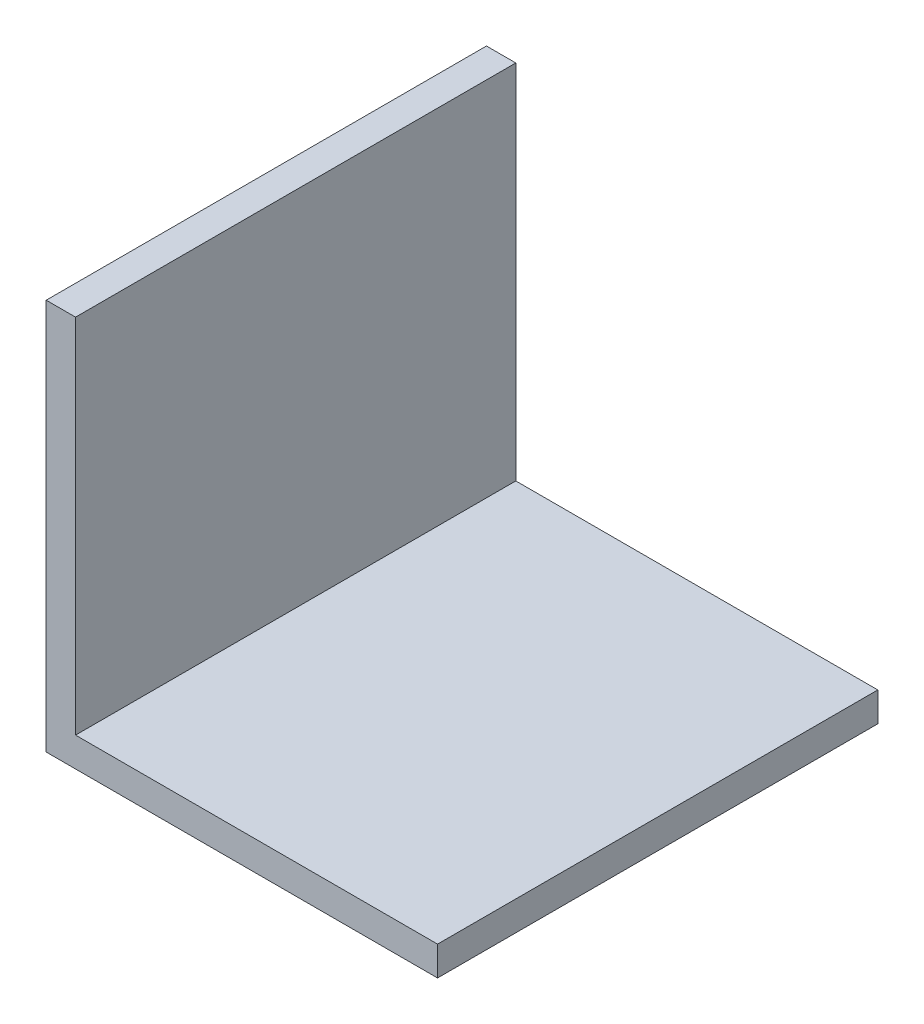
ISO-10303-21;
HEADER;
FILE_DESCRIPTION(('STEP AP214'),'2;1');
FILE_NAME('part.step','',(''),(''),'','','');
FILE_SCHEMA(('AUTOMOTIVE_DESIGN { 1 0 10303 214 1 1 1 1 }'));
ENDSEC;
DATA;
#1=APPLICATION_CONTEXT('core data for automotive mechanical design processes');
#2=APPLICATION_PROTOCOL_DEFINITION('international standard','automotive_design',2000,#1);
#3=PRODUCT_CONTEXT('',#1,'mechanical');
#4=PRODUCT('Part','Part','',(#3));
#5=PRODUCT_RELATED_PRODUCT_CATEGORY('part','',(#4));
#6=PRODUCT_DEFINITION_FORMATION('','',#4);
#7=PRODUCT_DEFINITION_CONTEXT('part definition',#1,'design');
#8=PRODUCT_DEFINITION('design','',#6,#7);
#9=PRODUCT_DEFINITION_SHAPE('','',#8);
#10=(LENGTH_UNIT() NAMED_UNIT(*) SI_UNIT(.MILLI.,.METRE.));
#11=(NAMED_UNIT(*) PLANE_ANGLE_UNIT() SI_UNIT($,.RADIAN.));
#12=(NAMED_UNIT(*) SI_UNIT($,.STERADIAN.) SOLID_ANGLE_UNIT());
#13=UNCERTAINTY_MEASURE_WITH_UNIT(LENGTH_MEASURE(1.E-05),#10,'distance_accuracy_value','');
#14=(GEOMETRIC_REPRESENTATION_CONTEXT(3) GLOBAL_UNCERTAINTY_ASSIGNED_CONTEXT((#13)) GLOBAL_UNIT_ASSIGNED_CONTEXT((#10,
#11,#12)) REPRESENTATION_CONTEXT('',''));
#15=CARTESIAN_POINT('',(0.,0.,0.));
#16=DIRECTION('',(0.,0.,1.));
#17=DIRECTION('',(1.,0.,0.));
#18=AXIS2_PLACEMENT_3D('',#15,#16,#17);
#19=CARTESIAN_POINT('',(0.,0.,90.));
#20=DIRECTION('',(1.,0.,0.));
#21=DIRECTION('',(0.,0.,-1.));
#22=AXIS2_PLACEMENT_3D('',#19,#20,#21);
#23=PLANE('',#22);
#24=DIRECTION('',(0.,-1.,0.));
#25=VECTOR('',#24,1.);
#26=CARTESIAN_POINT('',(0.,0.,0.));
#27=LINE('',#26,#25);
#28=CARTESIAN_POINT('',(0.,80.,0.));
#29=VERTEX_POINT('',#28);
#30=CARTESIAN_POINT('',(0.,0.,0.));
#31=VERTEX_POINT('',#30);
#32=EDGE_CURVE('E117',#29,#31,#27,.T.);
#33=ORIENTED_EDGE('',*,*,#32,.T.);
#34=DIRECTION('',(0.,0.,-1.));
#35=VECTOR('',#34,1.);
#36=CARTESIAN_POINT('',(0.,0.,90.));
#37=LINE('',#36,#35);
#38=CARTESIAN_POINT('',(0.,0.,90.));
#39=VERTEX_POINT('',#38);
#40=EDGE_CURVE('E11',#39,#31,#37,.T.);
#41=ORIENTED_EDGE('',*,*,#40,.F.);
#42=DIRECTION('',(0.,-1.,0.));
#43=VECTOR('',#42,1.);
#44=CARTESIAN_POINT('',(0.,0.,90.));
#45=LINE('',#44,#43);
#46=CARTESIAN_POINT('',(0.,80.,90.));
#47=VERTEX_POINT('',#46);
#48=EDGE_CURVE('E127',#47,#39,#45,.T.);
#49=ORIENTED_EDGE('',*,*,#48,.F.);
#50=DIRECTION('',(0.,0.,-1.));
#51=VECTOR('',#50,1.);
#52=CARTESIAN_POINT('',(0.,80.,90.));
#53=LINE('',#52,#51);
#54=EDGE_CURVE('E113',#47,#29,#53,.T.);
#55=ORIENTED_EDGE('',*,*,#54,.T.);
#56=EDGE_LOOP('',(#33,#41,#49,#55));
#57=FACE_BOUND('',#56,.T.);
#58=ADVANCED_FACE('F33',(#57),#23,.F.);
#59=CARTESIAN_POINT('',(0.,0.,90.));
#60=DIRECTION('',(0.,1.,0.));
#61=DIRECTION('',(0.,0.,1.));
#62=AXIS2_PLACEMENT_3D('',#59,#60,#61);
#63=PLANE('',#62);
#64=DIRECTION('',(1.,0.,0.));
#65=VECTOR('',#64,1.);
#66=CARTESIAN_POINT('',(0.,0.,0.));
#67=LINE('',#66,#65);
#68=CARTESIAN_POINT('',(80.,0.,0.));
#69=VERTEX_POINT('',#68);
#70=EDGE_CURVE('E120',#31,#69,#67,.T.);
#71=ORIENTED_EDGE('',*,*,#70,.T.);
#72=DIRECTION('',(0.,0.,-1.));
#73=VECTOR('',#72,1.);
#74=CARTESIAN_POINT('',(80.,0.,90.));
#75=LINE('',#74,#73);
#76=CARTESIAN_POINT('',(80.,0.,90.));
#77=VERTEX_POINT('',#76);
#78=EDGE_CURVE('E41',#77,#69,#75,.T.);
#79=ORIENTED_EDGE('',*,*,#78,.F.);
#80=DIRECTION('',(1.,0.,0.));
#81=VECTOR('',#80,1.);
#82=CARTESIAN_POINT('',(0.,0.,90.));
#83=LINE('',#82,#81);
#84=EDGE_CURVE('E86',#39,#77,#83,.T.);
#85=ORIENTED_EDGE('',*,*,#84,.F.);
#86=ORIENTED_EDGE('',*,*,#40,.T.);
#87=EDGE_LOOP('',(#71,#79,#85,#86));
#88=FACE_BOUND('',#87,.T.);
#89=ADVANCED_FACE('F151',(#88),#63,.F.);
#90=CARTESIAN_POINT('',(80.,0.,90.));
#91=DIRECTION('',(-1.,0.,0.));
#92=DIRECTION('',(0.,0.,1.));
#93=AXIS2_PLACEMENT_3D('',#90,#91,#92);
#94=PLANE('',#93);
#95=DIRECTION('',(0.,1.,0.));
#96=VECTOR('',#95,1.);
#97=CARTESIAN_POINT('',(80.,0.,0.));
#98=LINE('',#97,#96);
#99=CARTESIAN_POINT('',(80.,6.,0.));
#100=VERTEX_POINT('',#99);
#101=EDGE_CURVE('E122',#69,#100,#98,.T.);
#102=ORIENTED_EDGE('',*,*,#101,.T.);
#103=DIRECTION('',(0.,0.,-1.));
#104=VECTOR('',#103,1.);
#105=CARTESIAN_POINT('',(80.,6.,90.));
#106=LINE('',#105,#104);
#107=CARTESIAN_POINT('',(80.,6.,90.));
#108=VERTEX_POINT('',#107);
#109=EDGE_CURVE('E108',#108,#100,#106,.T.);
#110=ORIENTED_EDGE('',*,*,#109,.F.);
#111=DIRECTION('',(0.,1.,0.));
#112=VECTOR('',#111,1.);
#113=CARTESIAN_POINT('',(80.,0.,90.));
#114=LINE('',#113,#112);
#115=EDGE_CURVE('E99',#77,#108,#114,.T.);
#116=ORIENTED_EDGE('',*,*,#115,.F.);
#117=ORIENTED_EDGE('',*,*,#78,.T.);
#118=EDGE_LOOP('',(#102,#110,#116,#117));
#119=FACE_BOUND('',#118,.T.);
#120=ADVANCED_FACE('F133',(#119),#94,.F.);
#121=CARTESIAN_POINT('',(80.,6.,90.));
#122=DIRECTION('',(0.,-1.,0.));
#123=DIRECTION('',(1.,0.,0.));
#124=AXIS2_PLACEMENT_3D('',#121,#122,#123);
#125=PLANE('',#124);
#126=DIRECTION('',(-1.,0.,0.));
#127=VECTOR('',#126,1.);
#128=CARTESIAN_POINT('',(80.,6.,0.));
#129=LINE('',#128,#127);
#130=CARTESIAN_POINT('',(6.,6.,0.));
#131=VERTEX_POINT('',#130);
#132=EDGE_CURVE('E107',#100,#131,#129,.T.);
#133=ORIENTED_EDGE('',*,*,#132,.T.);
#134=DIRECTION('',(0.,0.,-1.));
#135=VECTOR('',#134,1.);
#136=CARTESIAN_POINT('',(6.,6.,90.));
#137=LINE('',#136,#135);
#138=CARTESIAN_POINT('',(6.,6.,90.));
#139=VERTEX_POINT('',#138);
#140=EDGE_CURVE('E104',#139,#131,#137,.T.);
#141=ORIENTED_EDGE('',*,*,#140,.F.);
#142=DIRECTION('',(-1.,0.,0.));
#143=VECTOR('',#142,1.);
#144=CARTESIAN_POINT('',(80.,6.,90.));
#145=LINE('',#144,#143);
#146=EDGE_CURVE('E93',#108,#139,#145,.T.);
#147=ORIENTED_EDGE('',*,*,#146,.F.);
#148=ORIENTED_EDGE('',*,*,#109,.T.);
#149=EDGE_LOOP('',(#133,#141,#147,#148));
#150=FACE_BOUND('',#149,.T.);
#151=ADVANCED_FACE('F105',(#150),#125,.F.);
#152=CARTESIAN_POINT('',(6.,6.,90.));
#153=DIRECTION('',(-1.,0.,0.));
#154=DIRECTION('',(0.,-1.,0.));
#155=AXIS2_PLACEMENT_3D('',#152,#153,#154);
#156=PLANE('',#155);
#157=DIRECTION('',(0.,1.,0.));
#158=VECTOR('',#157,1.);
#159=CARTESIAN_POINT('',(6.,6.,0.));
#160=LINE('',#159,#158);
#161=CARTESIAN_POINT('',(6.,80.,0.));
#162=VERTEX_POINT('',#161);
#163=EDGE_CURVE('E72',#131,#162,#160,.T.);
#164=ORIENTED_EDGE('',*,*,#163,.T.);
#165=DIRECTION('',(0.,0.,-1.));
#166=VECTOR('',#165,1.);
#167=CARTESIAN_POINT('',(6.,80.,90.));
#168=LINE('',#167,#166);
#169=CARTESIAN_POINT('',(6.,80.,90.));
#170=VERTEX_POINT('',#169);
#171=EDGE_CURVE('E109',#170,#162,#168,.T.);
#172=ORIENTED_EDGE('',*,*,#171,.F.);
#173=DIRECTION('',(0.,1.,0.));
#174=VECTOR('',#173,1.);
#175=CARTESIAN_POINT('',(6.,6.,90.));
#176=LINE('',#175,#174);
#177=EDGE_CURVE('E97',#139,#170,#176,.T.);
#178=ORIENTED_EDGE('',*,*,#177,.F.);
#179=ORIENTED_EDGE('',*,*,#140,.T.);
#180=EDGE_LOOP('',(#164,#172,#178,#179));
#181=FACE_BOUND('',#180,.T.);
#182=ADVANCED_FACE('F111',(#181),#156,.F.);
#183=CARTESIAN_POINT('',(0.,80.,90.));
#184=DIRECTION('',(0.,-1.,0.));
#185=DIRECTION('',(0.,0.,-1.));
#186=AXIS2_PLACEMENT_3D('',#183,#184,#185);
#187=PLANE('',#186);
#188=DIRECTION('',(-1.,0.,0.));
#189=VECTOR('',#188,1.);
#190=CARTESIAN_POINT('',(0.,80.,0.));
#191=LINE('',#190,#189);
#192=EDGE_CURVE('E78',#162,#29,#191,.T.);
#193=ORIENTED_EDGE('',*,*,#192,.T.);
#194=ORIENTED_EDGE('',*,*,#54,.F.);
#195=DIRECTION('',(-1.,0.,0.));
#196=VECTOR('',#195,1.);
#197=CARTESIAN_POINT('',(0.,80.,90.));
#198=LINE('',#197,#196);
#199=EDGE_CURVE('E49',#170,#47,#198,.T.);
#200=ORIENTED_EDGE('',*,*,#199,.F.);
#201=ORIENTED_EDGE('',*,*,#171,.T.);
#202=EDGE_LOOP('',(#193,#194,#200,#201));
#203=FACE_BOUND('',#202,.T.);
#204=ADVANCED_FACE('F140',(#203),#187,.F.);
#205=CARTESIAN_POINT('',(0.,80.,90.));
#206=DIRECTION('',(0.,0.,-1.));
#207=DIRECTION('',(-1.,0.,0.));
#208=AXIS2_PLACEMENT_3D('',#205,#206,#207);
#209=PLANE('',#208);
#210=ORIENTED_EDGE('',*,*,#48,.T.);
#211=ORIENTED_EDGE('',*,*,#84,.T.);
#212=ORIENTED_EDGE('',*,*,#115,.T.);
#213=ORIENTED_EDGE('',*,*,#146,.T.);
#214=ORIENTED_EDGE('',*,*,#177,.T.);
#215=ORIENTED_EDGE('',*,*,#199,.T.);
#216=EDGE_LOOP('',(#210,#211,#212,#213,#214,#215));
#217=FACE_BOUND('',#216,.T.);
#218=ADVANCED_FACE('F95',(#217),#209,.F.);
#219=CARTESIAN_POINT('',(0.,80.,0.));
#220=DIRECTION('',(0.,0.,-1.));
#221=DIRECTION('',(-1.,0.,0.));
#222=AXIS2_PLACEMENT_3D('',#219,#220,#221);
#223=PLANE('',#222);
#224=ORIENTED_EDGE('',*,*,#32,.F.);
#225=ORIENTED_EDGE('',*,*,#192,.F.);
#226=ORIENTED_EDGE('',*,*,#163,.F.);
#227=ORIENTED_EDGE('',*,*,#132,.F.);
#228=ORIENTED_EDGE('',*,*,#101,.F.);
#229=ORIENTED_EDGE('',*,*,#70,.F.);
#230=EDGE_LOOP('',(#224,#225,#226,#227,#228,#229));
#231=FACE_BOUND('',#230,.T.);
#232=ADVANCED_FACE('F136',(#231),#223,.T.);
#233=CLOSED_SHELL('',(#58,#89,#120,#151,#182,#204,#218,#232));
#234=MANIFOLD_SOLID_BREP('B2',#233);
#235=ADVANCED_BREP_SHAPE_REPRESENTATION('',(#18,#234),#14);
#236=SHAPE_DEFINITION_REPRESENTATION(#9,#235);
ENDSEC;
END-ISO-10303-21;
